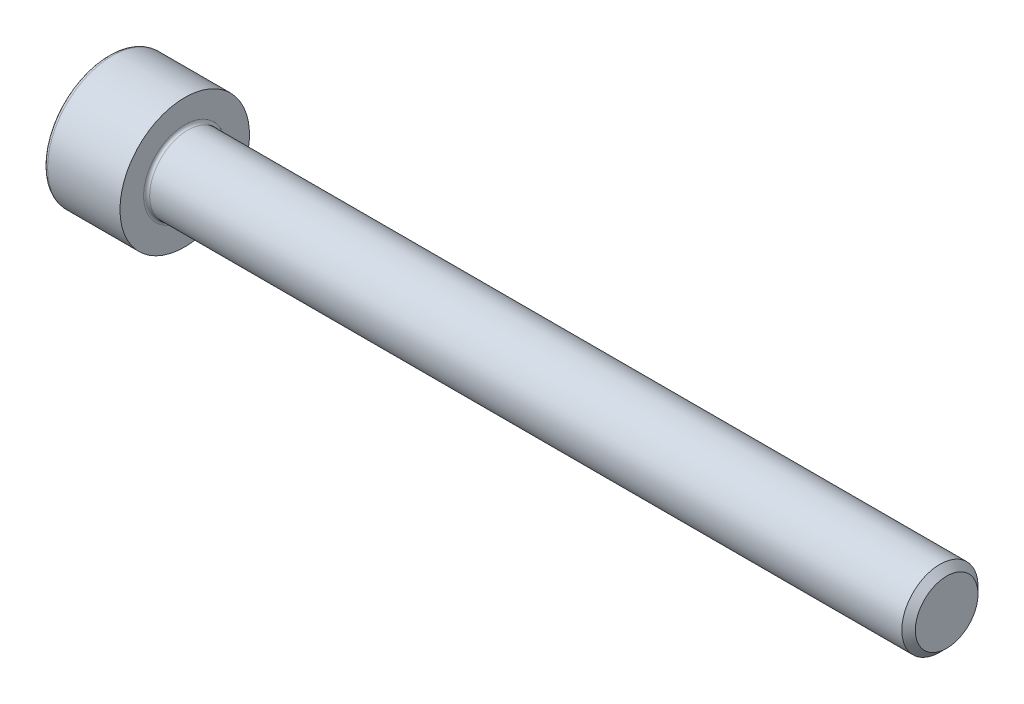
ISO-10303-21;
HEADER;
FILE_DESCRIPTION(('STEP AP214'),'2;1');
FILE_NAME('part.step','',(''),(''),'','','');
FILE_SCHEMA(('AUTOMOTIVE_DESIGN { 1 0 10303 214 1 1 1 1 }'));
ENDSEC;
DATA;
#1=APPLICATION_CONTEXT('core data for automotive mechanical design processes');
#2=APPLICATION_PROTOCOL_DEFINITION('international standard','automotive_design',2000,#1);
#3=PRODUCT_CONTEXT('',#1,'mechanical');
#4=PRODUCT('Part','Part','',(#3));
#5=PRODUCT_RELATED_PRODUCT_CATEGORY('part','',(#4));
#6=PRODUCT_DEFINITION_FORMATION('','',#4);
#7=PRODUCT_DEFINITION_CONTEXT('part definition',#1,'design');
#8=PRODUCT_DEFINITION('design','',#6,#7);
#9=PRODUCT_DEFINITION_SHAPE('','',#8);
#10=(LENGTH_UNIT() NAMED_UNIT(*) SI_UNIT(.MILLI.,.METRE.));
#11=(NAMED_UNIT(*) PLANE_ANGLE_UNIT() SI_UNIT($,.RADIAN.));
#12=(NAMED_UNIT(*) SI_UNIT($,.STERADIAN.) SOLID_ANGLE_UNIT());
#13=UNCERTAINTY_MEASURE_WITH_UNIT(LENGTH_MEASURE(1.E-05),#10,'distance_accuracy_value','');
#14=(GEOMETRIC_REPRESENTATION_CONTEXT(3) GLOBAL_UNCERTAINTY_ASSIGNED_CONTEXT((#13)) GLOBAL_UNIT_ASSIGNED_CONTEXT((#10,
#11,#12)) REPRESENTATION_CONTEXT('',''));
#15=CARTESIAN_POINT('',(0.,0.,0.));
#16=DIRECTION('',(0.,0.,1.));
#17=DIRECTION('',(1.,0.,0.));
#18=AXIS2_PLACEMENT_3D('',#15,#16,#17);
#19=CARTESIAN_POINT('',(0.,0.,0.));
#20=DIRECTION('',(-1.,0.,0.));
#21=DIRECTION('',(0.,0.,1.));
#22=AXIS2_PLACEMENT_3D('',#19,#20,#21);
#23=PLANE('',#22);
#24=DIRECTION('',(0.,-0.499999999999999,0.866025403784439));
#25=VECTOR('',#24,1.);
#26=CARTESIAN_POINT('',(0.,2.35789849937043,0.));
#27=LINE('',#26,#25);
#28=CARTESIAN_POINT('',(0.,2.35789849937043,0.));
#29=VERTEX_POINT('',#28);
#30=CARTESIAN_POINT('',(0.,1.17894924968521,2.042));
#31=VERTEX_POINT('',#30);
#32=EDGE_CURVE('E263',#29,#31,#27,.T.);
#33=ORIENTED_EDGE('',*,*,#32,.T.);
#34=DIRECTION('',(0.,1.,0.));
#35=VECTOR('',#34,1.);
#36=CARTESIAN_POINT('',(0.,-1.17894924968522,2.042));
#37=LINE('',#36,#35);
#38=CARTESIAN_POINT('',(0.,-1.17894924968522,2.042));
#39=VERTEX_POINT('',#38);
#40=EDGE_CURVE('E124',#39,#31,#37,.T.);
#41=ORIENTED_EDGE('',*,*,#40,.F.);
#42=DIRECTION('',(0.,-0.500000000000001,-0.866025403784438));
#43=VECTOR('',#42,1.);
#44=CARTESIAN_POINT('',(0.,-1.17894924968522,2.042));
#45=LINE('',#44,#43);
#46=CARTESIAN_POINT('',(0.,-2.35789849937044,0.));
#47=VERTEX_POINT('',#46);
#48=EDGE_CURVE('E266',#39,#47,#45,.T.);
#49=ORIENTED_EDGE('',*,*,#48,.T.);
#50=DIRECTION('',(0.,0.499999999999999,-0.866025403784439));
#51=VECTOR('',#50,1.);
#52=CARTESIAN_POINT('',(0.,-2.35789849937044,0.));
#53=LINE('',#52,#51);
#54=CARTESIAN_POINT('',(0.,-1.17894924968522,-2.042));
#55=VERTEX_POINT('',#54);
#56=EDGE_CURVE('E269',#47,#55,#53,.T.);
#57=ORIENTED_EDGE('',*,*,#56,.T.);
#58=DIRECTION('',(0.,-1.,0.));
#59=VECTOR('',#58,1.);
#60=CARTESIAN_POINT('',(0.,1.17894924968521,-2.042));
#61=LINE('',#60,#59);
#62=CARTESIAN_POINT('',(0.,1.17894924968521,-2.042));
#63=VERTEX_POINT('',#62);
#64=EDGE_CURVE('E272',#63,#55,#61,.T.);
#65=ORIENTED_EDGE('',*,*,#64,.F.);
#66=DIRECTION('',(0.,-0.500000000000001,-0.866025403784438));
#67=VECTOR('',#66,1.);
#68=CARTESIAN_POINT('',(0.,2.35789849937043,0.));
#69=LINE('',#68,#67);
#70=EDGE_CURVE('E119',#29,#63,#69,.T.);
#71=ORIENTED_EDGE('',*,*,#70,.F.);
#72=EDGE_LOOP('',(#33,#41,#49,#57,#65,#71));
#73=FACE_BOUND('',#72,.T.);
#74=CARTESIAN_POINT('',(0.,0.,0.));
#75=DIRECTION('',(-1.,0.,0.));
#76=DIRECTION('',(0.,0.,1.));
#77=AXIS2_PLACEMENT_3D('',#74,#75,#76);
#78=CIRCLE('',#77,4.);
#79=CARTESIAN_POINT('',(0.,0.,4.));
#80=VERTEX_POINT('',#79);
#81=EDGE_CURVE('E40',#80,#80,#78,.T.);
#82=ORIENTED_EDGE('',*,*,#81,.T.);
#83=EDGE_LOOP('',(#82));
#84=FACE_BOUND('',#83,.T.);
#85=ADVANCED_FACE('F32',(#73,#84),#23,.T.);
#86=CARTESIAN_POINT('',(-31.75,0.,0.));
#87=DIRECTION('',(-1.,0.,0.));
#88=DIRECTION('',(0.,0.,1.));
#89=AXIS2_PLACEMENT_3D('',#86,#87,#88);
#90=CYLINDRICAL_SURFACE('',#89,4.25);
#91=CARTESIAN_POINT('',(0.25,0.,0.));
#92=DIRECTION('',(-1.,0.,0.));
#93=DIRECTION('',(0.,0.,1.));
#94=AXIS2_PLACEMENT_3D('',#91,#92,#93);
#95=CIRCLE('',#94,4.25);
#96=CARTESIAN_POINT('',(0.25,0.,4.25));
#97=VERTEX_POINT('',#96);
#98=EDGE_CURVE('E11',#97,#97,#95,.F.);
#99=ORIENTED_EDGE('',*,*,#98,.T.);
#100=EDGE_LOOP('',(#99));
#101=FACE_BOUND('',#100,.T.);
#102=CARTESIAN_POINT('',(5.,0.,0.));
#103=DIRECTION('',(-1.,0.,0.));
#104=DIRECTION('',(0.,0.,1.));
#105=AXIS2_PLACEMENT_3D('',#102,#103,#104);
#106=CIRCLE('',#105,4.25);
#107=CARTESIAN_POINT('',(5.,0.,4.25));
#108=VERTEX_POINT('',#107);
#109=EDGE_CURVE('E142',#108,#108,#106,.T.);
#110=ORIENTED_EDGE('',*,*,#109,.T.);
#111=EDGE_LOOP('',(#110));
#112=FACE_BOUND('',#111,.T.);
#113=ADVANCED_FACE('F166',(#101,#112),#90,.T.);
#114=CARTESIAN_POINT('',(5.,4.25,0.));
#115=DIRECTION('',(1.,0.,0.));
#116=DIRECTION('',(0.,0.,-1.));
#117=AXIS2_PLACEMENT_3D('',#114,#115,#116);
#118=PLANE('',#117);
#119=CARTESIAN_POINT('',(5.,0.,0.));
#120=DIRECTION('',(1.,0.,0.));
#121=DIRECTION('',(0.,0.,-1.));
#122=AXIS2_PLACEMENT_3D('',#119,#120,#121);
#123=CIRCLE('',#122,2.69999999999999);
#124=CARTESIAN_POINT('',(5.,0.,-2.69999999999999));
#125=VERTEX_POINT('',#124);
#126=EDGE_CURVE('E145',#125,#125,#123,.F.);
#127=ORIENTED_EDGE('',*,*,#126,.T.);
#128=EDGE_LOOP('',(#127));
#129=FACE_BOUND('',#128,.T.);
#130=ORIENTED_EDGE('',*,*,#109,.F.);
#131=EDGE_LOOP('',(#130));
#132=FACE_BOUND('',#131,.T.);
#133=ADVANCED_FACE('F172',(#129,#132),#118,.T.);
#134=CARTESIAN_POINT('',(-31.75,0.,0.));
#135=DIRECTION('',(-1.,0.,0.));
#136=DIRECTION('',(0.,0.,1.));
#137=AXIS2_PLACEMENT_3D('',#134,#135,#136);
#138=CYLINDRICAL_SURFACE('',#137,2.49999999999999);
#139=CARTESIAN_POINT('',(5.2,0.,0.));
#140=DIRECTION('',(1.,0.,0.));
#141=DIRECTION('',(0.,0.,-1.));
#142=AXIS2_PLACEMENT_3D('',#139,#140,#141);
#143=CIRCLE('',#142,2.49999999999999);
#144=CARTESIAN_POINT('',(5.2,0.,-2.49999999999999));
#145=VERTEX_POINT('',#144);
#146=EDGE_CURVE('E148',#145,#145,#143,.T.);
#147=ORIENTED_EDGE('',*,*,#146,.T.);
#148=EDGE_LOOP('',(#147));
#149=FACE_BOUND('',#148,.T.);
#150=CARTESIAN_POINT('',(54.555,0.,0.));
#151=DIRECTION('',(-1.,0.,0.));
#152=DIRECTION('',(0.,0.,1.));
#153=AXIS2_PLACEMENT_3D('',#150,#151,#152);
#154=CIRCLE('',#153,2.49999999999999);
#155=CARTESIAN_POINT('',(54.555,0.,2.49999999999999));
#156=VERTEX_POINT('',#155);
#157=EDGE_CURVE('E139',#156,#156,#154,.T.);
#158=ORIENTED_EDGE('',*,*,#157,.T.);
#159=EDGE_LOOP('',(#158));
#160=FACE_BOUND('',#159,.T.);
#161=ADVANCED_FACE('F178',(#149,#160),#138,.T.);
#162=CARTESIAN_POINT('',(55.,0.,0.));
#163=DIRECTION('',(-1.,0.,0.));
#164=DIRECTION('',(0.,0.,1.));
#165=AXIS2_PLACEMENT_3D('',#162,#163,#164);
#166=CONICAL_SURFACE('',#165,2.055,0.785398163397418);
#167=ORIENTED_EDGE('',*,*,#157,.F.);
#168=EDGE_LOOP('',(#167));
#169=FACE_BOUND('',#168,.T.);
#170=CARTESIAN_POINT('',(55.,0.,0.));
#171=DIRECTION('',(-1.,0.,0.));
#172=DIRECTION('',(0.,0.,1.));
#173=AXIS2_PLACEMENT_3D('',#170,#171,#172);
#174=CIRCLE('',#173,2.055);
#175=CARTESIAN_POINT('',(55.,0.,2.055));
#176=VERTEX_POINT('',#175);
#177=EDGE_CURVE('E135',#176,#176,#174,.T.);
#178=ORIENTED_EDGE('',*,*,#177,.T.);
#179=EDGE_LOOP('',(#178));
#180=FACE_BOUND('',#179,.T.);
#181=ADVANCED_FACE('F182',(#169,#180),#166,.T.);
#182=CARTESIAN_POINT('',(55.,2.055,0.));
#183=DIRECTION('',(1.,0.,0.));
#184=DIRECTION('',(0.,0.,-1.));
#185=AXIS2_PLACEMENT_3D('',#182,#183,#184);
#186=PLANE('',#185);
#187=ORIENTED_EDGE('',*,*,#177,.F.);
#188=EDGE_LOOP('',(#187));
#189=FACE_BOUND('',#188,.T.);
#190=ADVANCED_FACE('F162',(#189),#186,.T.);
#191=CARTESIAN_POINT('',(5.2,0.,0.));
#192=DIRECTION('',(1.,0.,0.));
#193=DIRECTION('',(0.,0.,-1.));
#194=AXIS2_PLACEMENT_3D('',#191,#192,#193);
#195=TOROIDAL_SURFACE('',#194,2.69999999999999,0.2);
#196=ORIENTED_EDGE('',*,*,#146,.F.);
#197=EDGE_LOOP('',(#196));
#198=FACE_BOUND('',#197,.T.);
#199=ORIENTED_EDGE('',*,*,#126,.F.);
#200=EDGE_LOOP('',(#199));
#201=FACE_BOUND('',#200,.T.);
#202=ADVANCED_FACE('F155',(#198,#201),#195,.F.);
#203=CARTESIAN_POINT('',(0.25,0.,0.));
#204=DIRECTION('',(-1.,0.,0.));
#205=DIRECTION('',(0.,0.,1.));
#206=AXIS2_PLACEMENT_3D('',#203,#204,#205);
#207=TOROIDAL_SURFACE('',#206,4.,0.25);
#208=ORIENTED_EDGE('',*,*,#98,.F.);
#209=EDGE_LOOP('',(#208));
#210=FACE_BOUND('',#209,.T.);
#211=ORIENTED_EDGE('',*,*,#81,.F.);
#212=EDGE_LOOP('',(#211));
#213=FACE_BOUND('',#212,.T.);
#214=ADVANCED_FACE('F34',(#210,#213),#207,.T.);
#215=CARTESIAN_POINT('',(2.5,2.35789849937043,0.));
#216=DIRECTION('',(0.,-0.866025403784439,-0.499999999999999));
#217=DIRECTION('',(0.,0.499999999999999,-0.866025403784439));
#218=AXIS2_PLACEMENT_3D('',#215,#216,#217);
#219=PLANE('',#218);
#220=ORIENTED_EDGE('',*,*,#32,.F.);
#221=DIRECTION('',(-1.,0.,0.));
#222=VECTOR('',#221,1.);
#223=CARTESIAN_POINT('',(2.5,2.35789849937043,0.));
#224=LINE('',#223,#222);
#225=CARTESIAN_POINT('',(2.5,2.35789849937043,0.));
#226=VERTEX_POINT('',#225);
#227=EDGE_CURVE('E262',#226,#29,#224,.T.);
#228=ORIENTED_EDGE('',*,*,#227,.F.);
#229=DIRECTION('',(0.,-0.499999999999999,0.866025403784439));
#230=VECTOR('',#229,1.);
#231=CARTESIAN_POINT('',(2.5,2.35789849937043,0.));
#232=LINE('',#231,#230);
#233=CARTESIAN_POINT('',(2.5,1.76842387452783,1.021));
#234=VERTEX_POINT('',#233);
#235=EDGE_CURVE('E47',#226,#234,#232,.T.);
#236=ORIENTED_EDGE('',*,*,#235,.T.);
#237=CARTESIAN_POINT('',(2.5,1.17894924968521,2.042));
#238=VERTEX_POINT('',#237);
#239=EDGE_CURVE('E105',#234,#238,#232,.T.);
#240=ORIENTED_EDGE('',*,*,#239,.T.);
#241=DIRECTION('',(-1.,0.,0.));
#242=VECTOR('',#241,1.);
#243=CARTESIAN_POINT('',(2.5,1.17894924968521,2.042));
#244=LINE('',#243,#242);
#245=EDGE_CURVE('E117',#238,#31,#244,.T.);
#246=ORIENTED_EDGE('',*,*,#245,.T.);
#247=EDGE_LOOP('',(#220,#228,#236,#240,#246));
#248=FACE_BOUND('',#247,.T.);
#249=ADVANCED_FACE('F116',(#248),#219,.T.);
#250=CARTESIAN_POINT('',(2.5,-1.17894924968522,2.042));
#251=DIRECTION('',(0.,0.,1.));
#252=DIRECTION('',(0.,-1.,0.));
#253=AXIS2_PLACEMENT_3D('',#250,#251,#252);
#254=PLANE('',#253);
#255=ORIENTED_EDGE('',*,*,#40,.T.);
#256=ORIENTED_EDGE('',*,*,#245,.F.);
#257=DIRECTION('',(0.,1.,0.));
#258=VECTOR('',#257,1.);
#259=CARTESIAN_POINT('',(2.5,-1.17894924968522,2.042));
#260=LINE('',#259,#258);
#261=CARTESIAN_POINT('',(2.5,0.,2.042));
#262=VERTEX_POINT('',#261);
#263=EDGE_CURVE('E103',#262,#238,#260,.T.);
#264=ORIENTED_EDGE('',*,*,#263,.F.);
#265=CARTESIAN_POINT('',(2.5,-1.17894924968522,2.042));
#266=VERTEX_POINT('',#265);
#267=EDGE_CURVE('E113',#266,#262,#260,.T.);
#268=ORIENTED_EDGE('',*,*,#267,.F.);
#269=DIRECTION('',(-1.,0.,0.));
#270=VECTOR('',#269,1.);
#271=CARTESIAN_POINT('',(2.5,-1.17894924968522,2.042));
#272=LINE('',#271,#270);
#273=EDGE_CURVE('E126',#266,#39,#272,.T.);
#274=ORIENTED_EDGE('',*,*,#273,.T.);
#275=EDGE_LOOP('',(#255,#256,#264,#268,#274));
#276=FACE_BOUND('',#275,.T.);
#277=ADVANCED_FACE('F121',(#276),#254,.F.);
#278=CARTESIAN_POINT('',(2.5,-1.17894924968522,2.042));
#279=DIRECTION('',(0.,0.866025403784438,-0.500000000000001));
#280=DIRECTION('',(0.,0.500000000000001,0.866025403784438));
#281=AXIS2_PLACEMENT_3D('',#278,#279,#280);
#282=PLANE('',#281);
#283=ORIENTED_EDGE('',*,*,#48,.F.);
#284=ORIENTED_EDGE('',*,*,#273,.F.);
#285=DIRECTION('',(0.,-0.500000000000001,-0.866025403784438));
#286=VECTOR('',#285,1.);
#287=CARTESIAN_POINT('',(2.5,-1.17894924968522,2.042));
#288=LINE('',#287,#286);
#289=CARTESIAN_POINT('',(2.5,-1.76842387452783,1.021));
#290=VERTEX_POINT('',#289);
#291=EDGE_CURVE('E243',#266,#290,#288,.T.);
#292=ORIENTED_EDGE('',*,*,#291,.T.);
#293=CARTESIAN_POINT('',(2.5,-2.35789849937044,0.));
#294=VERTEX_POINT('',#293);
#295=EDGE_CURVE('E245',#290,#294,#288,.T.);
#296=ORIENTED_EDGE('',*,*,#295,.T.);
#297=DIRECTION('',(-1.,0.,0.));
#298=VECTOR('',#297,1.);
#299=CARTESIAN_POINT('',(2.5,-2.35789849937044,0.));
#300=LINE('',#299,#298);
#301=EDGE_CURVE('E131',#294,#47,#300,.T.);
#302=ORIENTED_EDGE('',*,*,#301,.T.);
#303=EDGE_LOOP('',(#283,#284,#292,#296,#302));
#304=FACE_BOUND('',#303,.T.);
#305=ADVANCED_FACE('F195',(#304),#282,.T.);
#306=CARTESIAN_POINT('',(2.5,-2.35789849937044,0.));
#307=DIRECTION('',(0.,0.866025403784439,0.499999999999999));
#308=DIRECTION('',(0.,-0.499999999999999,0.866025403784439));
#309=AXIS2_PLACEMENT_3D('',#306,#307,#308);
#310=PLANE('',#309);
#311=ORIENTED_EDGE('',*,*,#56,.F.);
#312=ORIENTED_EDGE('',*,*,#301,.F.);
#313=DIRECTION('',(0.,0.499999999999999,-0.866025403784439));
#314=VECTOR('',#313,1.);
#315=CARTESIAN_POINT('',(2.5,-2.35789849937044,0.));
#316=LINE('',#315,#314);
#317=CARTESIAN_POINT('',(2.5,-1.76842387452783,-1.021));
#318=VERTEX_POINT('',#317);
#319=EDGE_CURVE('E248',#294,#318,#316,.T.);
#320=ORIENTED_EDGE('',*,*,#319,.T.);
#321=CARTESIAN_POINT('',(2.5,-1.17894924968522,-2.042));
#322=VERTEX_POINT('',#321);
#323=EDGE_CURVE('E252',#318,#322,#316,.T.);
#324=ORIENTED_EDGE('',*,*,#323,.T.);
#325=DIRECTION('',(-1.,0.,0.));
#326=VECTOR('',#325,1.);
#327=CARTESIAN_POINT('',(2.5,-1.17894924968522,-2.042));
#328=LINE('',#327,#326);
#329=EDGE_CURVE('E281',#322,#55,#328,.T.);
#330=ORIENTED_EDGE('',*,*,#329,.T.);
#331=EDGE_LOOP('',(#311,#312,#320,#324,#330));
#332=FACE_BOUND('',#331,.T.);
#333=ADVANCED_FACE('F198',(#332),#310,.T.);
#334=CARTESIAN_POINT('',(2.5,1.17894924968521,-2.042));
#335=DIRECTION('',(0.,0.,-1.));
#336=DIRECTION('',(0.,1.,0.));
#337=AXIS2_PLACEMENT_3D('',#334,#335,#336);
#338=PLANE('',#337);
#339=ORIENTED_EDGE('',*,*,#64,.T.);
#340=ORIENTED_EDGE('',*,*,#329,.F.);
#341=DIRECTION('',(0.,-1.,0.));
#342=VECTOR('',#341,1.);
#343=CARTESIAN_POINT('',(2.5,1.17894924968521,-2.042));
#344=LINE('',#343,#342);
#345=CARTESIAN_POINT('',(2.5,0.,-2.042));
#346=VERTEX_POINT('',#345);
#347=EDGE_CURVE('E256',#346,#322,#344,.T.);
#348=ORIENTED_EDGE('',*,*,#347,.F.);
#349=CARTESIAN_POINT('',(2.5,1.17894924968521,-2.042));
#350=VERTEX_POINT('',#349);
#351=EDGE_CURVE('E257',#350,#346,#344,.T.);
#352=ORIENTED_EDGE('',*,*,#351,.F.);
#353=DIRECTION('',(-1.,0.,0.));
#354=VECTOR('',#353,1.);
#355=CARTESIAN_POINT('',(2.5,1.17894924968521,-2.042));
#356=LINE('',#355,#354);
#357=EDGE_CURVE('E278',#350,#63,#356,.T.);
#358=ORIENTED_EDGE('',*,*,#357,.T.);
#359=EDGE_LOOP('',(#339,#340,#348,#352,#358));
#360=FACE_BOUND('',#359,.T.);
#361=ADVANCED_FACE('F202',(#360),#338,.F.);
#362=CARTESIAN_POINT('',(2.5,2.35789849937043,0.));
#363=DIRECTION('',(0.,0.866025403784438,-0.500000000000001));
#364=DIRECTION('',(0.,0.500000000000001,0.866025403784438));
#365=AXIS2_PLACEMENT_3D('',#362,#363,#364);
#366=PLANE('',#365);
#367=ORIENTED_EDGE('',*,*,#70,.T.);
#368=ORIENTED_EDGE('',*,*,#357,.F.);
#369=DIRECTION('',(0.,-0.500000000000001,-0.866025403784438));
#370=VECTOR('',#369,1.);
#371=CARTESIAN_POINT('',(2.5,2.35789849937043,0.));
#372=LINE('',#371,#370);
#373=CARTESIAN_POINT('',(2.5,1.76842387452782,-1.021));
#374=VERTEX_POINT('',#373);
#375=EDGE_CURVE('E260',#374,#350,#372,.T.);
#376=ORIENTED_EDGE('',*,*,#375,.F.);
#377=EDGE_CURVE('E234',#226,#374,#372,.T.);
#378=ORIENTED_EDGE('',*,*,#377,.F.);
#379=ORIENTED_EDGE('',*,*,#227,.T.);
#380=EDGE_LOOP('',(#367,#368,#376,#378,#379));
#381=FACE_BOUND('',#380,.T.);
#382=ADVANCED_FACE('F206',(#381),#366,.F.);
#383=CARTESIAN_POINT('',(2.5,1.17894924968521,2.042));
#384=DIRECTION('',(-1.,0.,0.));
#385=DIRECTION('',(0.,0.,1.));
#386=AXIS2_PLACEMENT_3D('',#383,#384,#385);
#387=PLANE('',#386);
#388=CARTESIAN_POINT('',(2.5,0.,0.));
#389=DIRECTION('',(-1.,0.,0.));
#390=DIRECTION('',(0.,0.,1.));
#391=AXIS2_PLACEMENT_3D('',#388,#389,#390);
#392=CIRCLE('',#391,2.042);
#393=EDGE_CURVE('E125',#290,#262,#392,.T.);
#394=ORIENTED_EDGE('',*,*,#393,.F.);
#395=ORIENTED_EDGE('',*,*,#291,.F.);
#396=ORIENTED_EDGE('',*,*,#267,.T.);
#397=EDGE_LOOP('',(#394,#395,#396));
#398=FACE_BOUND('',#397,.T.);
#399=ADVANCED_FACE('F210',(#398),#387,.T.);
#400=EDGE_CURVE('E129',#318,#290,#392,.T.);
#401=ORIENTED_EDGE('',*,*,#400,.F.);
#402=ORIENTED_EDGE('',*,*,#319,.F.);
#403=ORIENTED_EDGE('',*,*,#295,.F.);
#404=EDGE_LOOP('',(#401,#402,#403));
#405=FACE_BOUND('',#404,.T.);
#406=ADVANCED_FACE('F213',(#405),#387,.T.);
#407=EDGE_CURVE('E287',#346,#318,#392,.T.);
#408=ORIENTED_EDGE('',*,*,#407,.F.);
#409=ORIENTED_EDGE('',*,*,#347,.T.);
#410=ORIENTED_EDGE('',*,*,#323,.F.);
#411=EDGE_LOOP('',(#408,#409,#410));
#412=FACE_BOUND('',#411,.T.);
#413=ADVANCED_FACE('F218',(#412),#387,.T.);
#414=EDGE_CURVE('E237',#374,#346,#392,.T.);
#415=ORIENTED_EDGE('',*,*,#414,.F.);
#416=ORIENTED_EDGE('',*,*,#375,.T.);
#417=ORIENTED_EDGE('',*,*,#351,.T.);
#418=EDGE_LOOP('',(#415,#416,#417));
#419=FACE_BOUND('',#418,.T.);
#420=ADVANCED_FACE('F225',(#419),#387,.T.);
#421=EDGE_CURVE('E136',#234,#374,#392,.T.);
#422=ORIENTED_EDGE('',*,*,#421,.F.);
#423=ORIENTED_EDGE('',*,*,#235,.F.);
#424=ORIENTED_EDGE('',*,*,#377,.T.);
#425=EDGE_LOOP('',(#422,#423,#424));
#426=FACE_BOUND('',#425,.T.);
#427=ADVANCED_FACE('F221',(#426),#387,.T.);
#428=EDGE_CURVE('E108',#262,#234,#392,.T.);
#429=ORIENTED_EDGE('',*,*,#428,.F.);
#430=ORIENTED_EDGE('',*,*,#263,.T.);
#431=ORIENTED_EDGE('',*,*,#239,.F.);
#432=EDGE_LOOP('',(#429,#430,#431));
#433=FACE_BOUND('',#432,.T.);
#434=ADVANCED_FACE('F104',(#433),#387,.T.);
#435=CARTESIAN_POINT('',(2.5,0.,0.));
#436=DIRECTION('',(-1.,0.,0.));
#437=DIRECTION('',(0.,0.,1.));
#438=AXIS2_PLACEMENT_3D('',#435,#436,#437);
#439=CONICAL_SURFACE('',#438,2.042,1.04719755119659);
#440=CARTESIAN_POINT('',(3.67894924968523,0.,0.));
#441=VERTEX_POINT('',#440);
#442=VERTEX_LOOP('',#441);
#443=FACE_BOUND('',#442,.T.);
#444=ORIENTED_EDGE('',*,*,#428,.T.);
#445=ORIENTED_EDGE('',*,*,#421,.T.);
#446=ORIENTED_EDGE('',*,*,#414,.T.);
#447=ORIENTED_EDGE('',*,*,#407,.T.);
#448=ORIENTED_EDGE('',*,*,#400,.T.);
#449=ORIENTED_EDGE('',*,*,#393,.T.);
#450=EDGE_LOOP('',(#444,#445,#446,#447,#448,#449));
#451=FACE_BOUND('',#450,.T.);
#452=ADVANCED_FACE('F190',(#443,#451),#439,.F.);
#453=CLOSED_SHELL('',(#85,#113,#133,#161,#181,#190,#202,#214,#249,#277,#305,#333,#361,#382,#399,
#406,#413,#420,#427,#434,#452));
#454=MANIFOLD_SOLID_BREP('B2',#453);
#455=ADVANCED_BREP_SHAPE_REPRESENTATION('',(#18,#454),#14);
#456=SHAPE_DEFINITION_REPRESENTATION(#9,#455);
ENDSEC;
END-ISO-10303-21;
